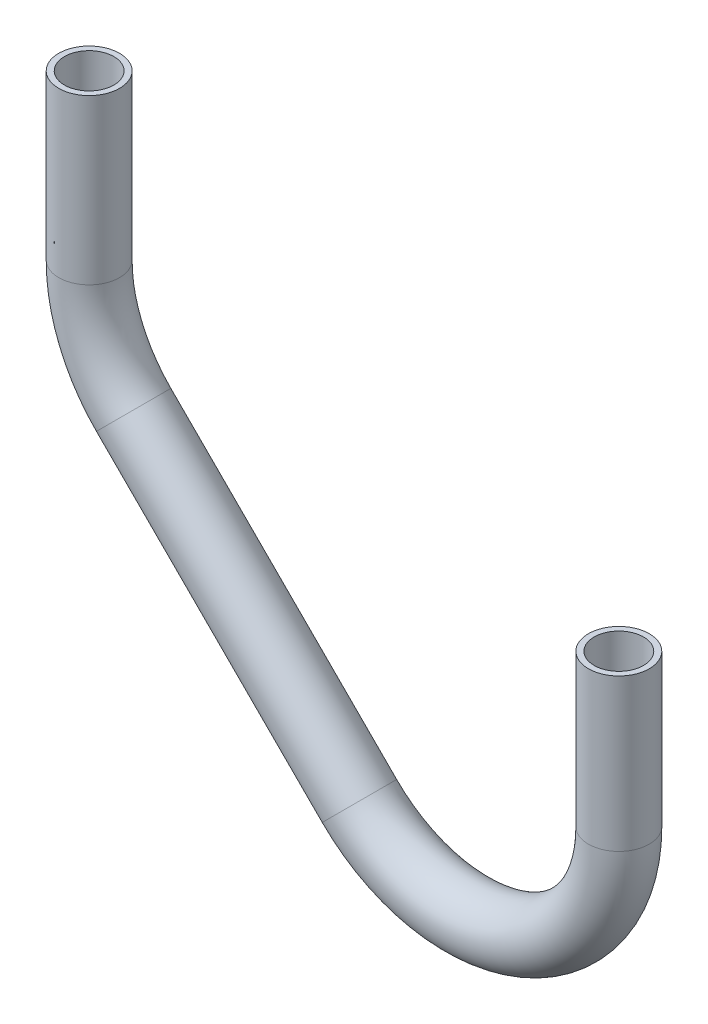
from build123d import *

# Parameters (mm, degrees)
SKETCH2_R   = 4.7625
SKETCH2_R_2 = 3.8735


with BuildPart() as part:
    # Sweep1: sweep along a path in Sketch1
    with BuildLine(Plane.XY) as sweep1_path:
        Line((0, 0), (0, -23.8125))
        ThreePointArc((0, -23.8125), (-14.699850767, -45.812381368), (-40.650480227, -40.650480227))
        Line((-40.650480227, -40.650480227), (-76.037347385, -5.263613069))
        ThreePointArc((-76.037347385, -5.263613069), (-81.199248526, 2.461717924), (-83.011867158, 11.574367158))
        Line((-83.011867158, 11.574367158), (-83.011867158, 37.264307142))
    # Sketch2 → Sweep1 (sweep)
    with BuildSketch(Plane(origin=(0, 0, 0), x_dir=(0, 0, -1), z_dir=(0, 1, 0))):
        Circle(SKETCH2_R)
        Circle(SKETCH2_R_2, mode=Mode.SUBTRACT)
    sweep(path=sweep1_path.line)


solid = part.part
